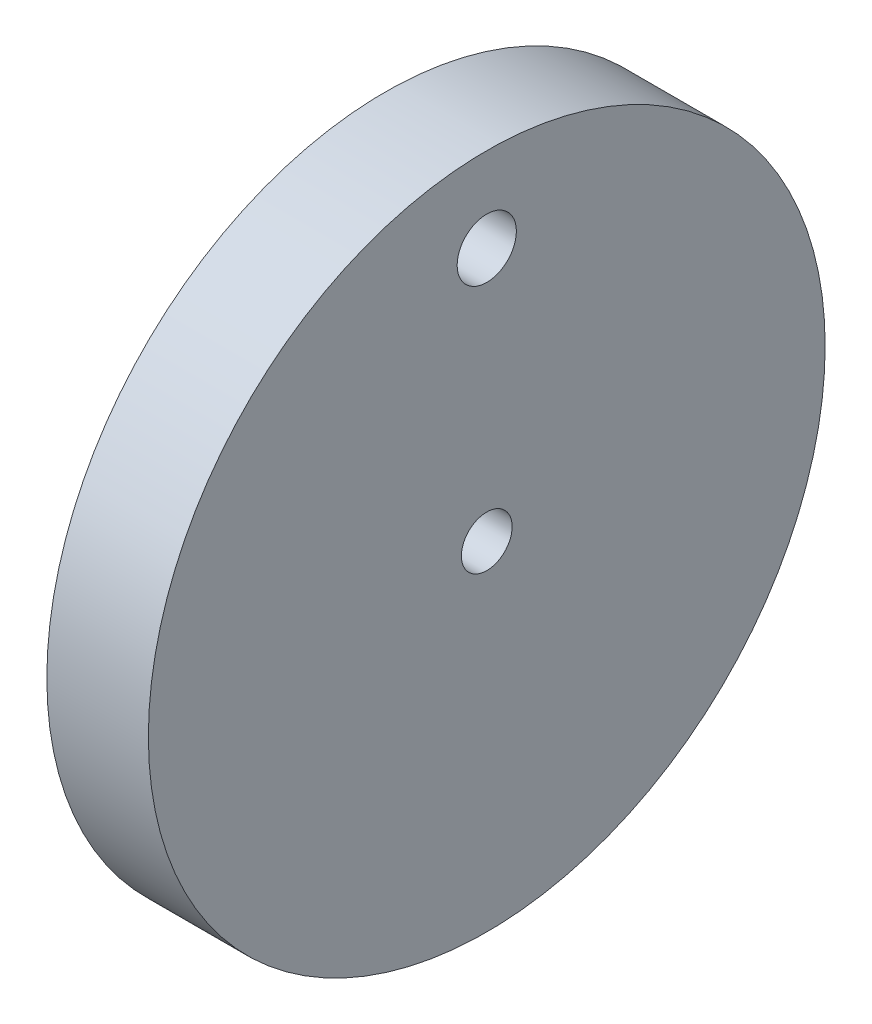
from build123d import *

# Parameters (mm, degrees)
SKETCH1_R      = 20
SKETCH1_R_2    = 1.5
SKETCH1_R_3    = 1.75
EXTRUDE1_DEPTH = 6
SKETCH2_R      = 3.25
EXTRUDE2_DEPTH = 3


with BuildPart() as part:
    # Sketch1 → Extrude1 (new body)
    with BuildSketch(Plane(origin=(0, 0, 0), x_dir=(0, 0, -1), z_dir=(1, 0, 0))):
        Circle(SKETCH1_R)
        Circle(SKETCH1_R_2, mode=Mode.SUBTRACT)
        with Locations((0, 15)):
            Circle(SKETCH1_R_3, mode=Mode.SUBTRACT)
    extrude(amount=EXTRUDE1_DEPTH)

    # Sketch2 → Extrude2 (cut)
    with BuildSketch(Plane.ZY):
        with Locations((0, 15)):
            Circle(SKETCH2_R)
    extrude(amount=-EXTRUDE2_DEPTH, mode=Mode.SUBTRACT)


solid = part.part
